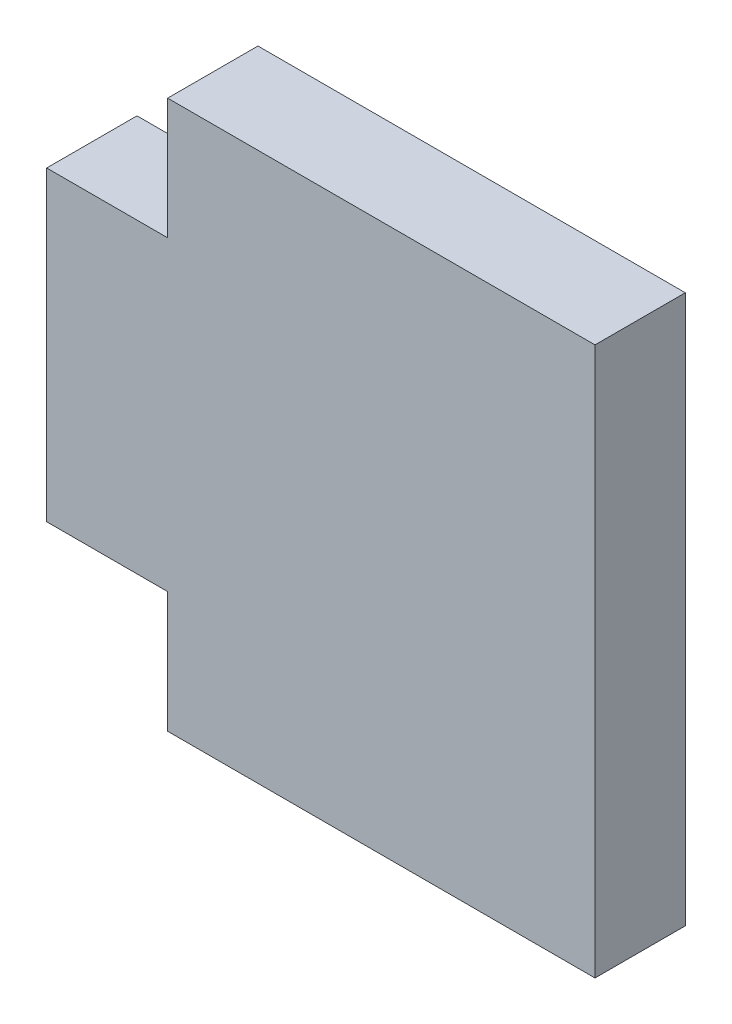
ISO-10303-21;
HEADER;
FILE_DESCRIPTION(('STEP AP214'),'2;1');
FILE_NAME('part.step','',(''),(''),'','','');
FILE_SCHEMA(('AUTOMOTIVE_DESIGN { 1 0 10303 214 1 1 1 1 }'));
ENDSEC;
DATA;
#1=APPLICATION_CONTEXT('core data for automotive mechanical design processes');
#2=APPLICATION_PROTOCOL_DEFINITION('international standard','automotive_design',2000,#1);
#3=PRODUCT_CONTEXT('',#1,'mechanical');
#4=PRODUCT('Part','Part','',(#3));
#5=PRODUCT_RELATED_PRODUCT_CATEGORY('part','',(#4));
#6=PRODUCT_DEFINITION_FORMATION('','',#4);
#7=PRODUCT_DEFINITION_CONTEXT('part definition',#1,'design');
#8=PRODUCT_DEFINITION('design','',#6,#7);
#9=PRODUCT_DEFINITION_SHAPE('','',#8);
#10=(LENGTH_UNIT() NAMED_UNIT(*) SI_UNIT(.MILLI.,.METRE.));
#11=(NAMED_UNIT(*) PLANE_ANGLE_UNIT() SI_UNIT($,.RADIAN.));
#12=(NAMED_UNIT(*) SI_UNIT($,.STERADIAN.) SOLID_ANGLE_UNIT());
#13=UNCERTAINTY_MEASURE_WITH_UNIT(LENGTH_MEASURE(1.E-05),#10,'distance_accuracy_value','');
#14=(GEOMETRIC_REPRESENTATION_CONTEXT(3) GLOBAL_UNCERTAINTY_ASSIGNED_CONTEXT((#13)) GLOBAL_UNIT_ASSIGNED_CONTEXT((#10,
#11,#12)) REPRESENTATION_CONTEXT('',''));
#15=CARTESIAN_POINT('',(0.,0.,0.));
#16=DIRECTION('',(0.,0.,1.));
#17=DIRECTION('',(1.,0.,0.));
#18=AXIS2_PLACEMENT_3D('',#15,#16,#17);
#19=CARTESIAN_POINT('',(0.,0.,7.112));
#20=DIRECTION('',(1.,0.,0.));
#21=DIRECTION('',(0.,1.,0.));
#22=AXIS2_PLACEMENT_3D('',#19,#20,#21);
#23=PLANE('',#22);
#24=DIRECTION('',(0.,-1.,0.));
#25=VECTOR('',#24,1.);
#26=CARTESIAN_POINT('',(0.,0.,7.112));
#27=LINE('',#26,#25);
#28=CARTESIAN_POINT('',(0.,33.655,7.112));
#29=VERTEX_POINT('',#28);
#30=CARTESIAN_POINT('',(0.,9.525,7.112));
#31=VERTEX_POINT('',#30);
#32=EDGE_CURVE('E125',#29,#31,#27,.T.);
#33=ORIENTED_EDGE('',*,*,#32,.F.);
#34=DIRECTION('',(0.,0.,1.));
#35=VECTOR('',#34,1.);
#36=CARTESIAN_POINT('',(0.,33.655,-11.684));
#37=LINE('',#36,#35);
#38=CARTESIAN_POINT('',(0.,33.655,0.));
#39=VERTEX_POINT('',#38);
#40=EDGE_CURVE('E107',#39,#29,#37,.T.);
#41=ORIENTED_EDGE('',*,*,#40,.F.);
#42=DIRECTION('',(0.,-1.,0.));
#43=VECTOR('',#42,1.);
#44=CARTESIAN_POINT('',(0.,0.,0.));
#45=LINE('',#44,#43);
#46=CARTESIAN_POINT('',(0.,9.525,0.));
#47=VERTEX_POINT('',#46);
#48=EDGE_CURVE('E151',#39,#47,#45,.T.);
#49=ORIENTED_EDGE('',*,*,#48,.T.);
#50=DIRECTION('',(0.,0.,1.));
#51=VECTOR('',#50,1.);
#52=CARTESIAN_POINT('',(0.,9.525,-11.684));
#53=LINE('',#52,#51);
#54=EDGE_CURVE('E130',#47,#31,#53,.T.);
#55=ORIENTED_EDGE('',*,*,#54,.T.);
#56=EDGE_LOOP('',(#33,#41,#49,#55));
#57=FACE_BOUND('',#56,.T.);
#58=ADVANCED_FACE('F45',(#57),#23,.F.);
#59=CARTESIAN_POINT('',(0.,0.,7.112));
#60=DIRECTION('',(0.,1.,0.));
#61=DIRECTION('',(0.,0.,1.));
#62=AXIS2_PLACEMENT_3D('',#59,#60,#61);
#63=PLANE('',#62);
#64=DIRECTION('',(1.,0.,0.));
#65=VECTOR('',#64,1.);
#66=CARTESIAN_POINT('',(0.,0.,7.112));
#67=LINE('',#66,#65);
#68=CARTESIAN_POINT('',(9.525,0.,7.112));
#69=VERTEX_POINT('',#68);
#70=CARTESIAN_POINT('',(43.18,0.,7.112));
#71=VERTEX_POINT('',#70);
#72=EDGE_CURVE('E132',#69,#71,#67,.T.);
#73=ORIENTED_EDGE('',*,*,#72,.F.);
#74=DIRECTION('',(0.,0.,1.));
#75=VECTOR('',#74,1.);
#76=CARTESIAN_POINT('',(9.525,0.,-11.684));
#77=LINE('',#76,#75);
#78=CARTESIAN_POINT('',(9.525,0.,0.));
#79=VERTEX_POINT('',#78);
#80=EDGE_CURVE('E184',#79,#69,#77,.T.);
#81=ORIENTED_EDGE('',*,*,#80,.F.);
#82=DIRECTION('',(1.,0.,0.));
#83=VECTOR('',#82,1.);
#84=CARTESIAN_POINT('',(0.,0.,0.));
#85=LINE('',#84,#83);
#86=CARTESIAN_POINT('',(43.18,0.,0.));
#87=VERTEX_POINT('',#86);
#88=EDGE_CURVE('E154',#79,#87,#85,.T.);
#89=ORIENTED_EDGE('',*,*,#88,.T.);
#90=DIRECTION('',(0.,0.,-1.));
#91=VECTOR('',#90,1.);
#92=CARTESIAN_POINT('',(43.18,0.,7.112));
#93=LINE('',#92,#91);
#94=EDGE_CURVE('E163',#71,#87,#93,.T.);
#95=ORIENTED_EDGE('',*,*,#94,.F.);
#96=EDGE_LOOP('',(#73,#81,#89,#95));
#97=FACE_BOUND('',#96,.T.);
#98=ADVANCED_FACE('F188',(#97),#63,.F.);
#99=CARTESIAN_POINT('',(43.18,0.,7.112));
#100=DIRECTION('',(-1.,0.,0.));
#101=DIRECTION('',(0.,-1.,0.));
#102=AXIS2_PLACEMENT_3D('',#99,#100,#101);
#103=PLANE('',#102);
#104=DIRECTION('',(0.,1.,0.));
#105=VECTOR('',#104,1.);
#106=CARTESIAN_POINT('',(43.18,0.,0.));
#107=LINE('',#106,#105);
#108=CARTESIAN_POINT('',(43.18,43.18,0.));
#109=VERTEX_POINT('',#108);
#110=EDGE_CURVE('E140',#87,#109,#107,.T.);
#111=ORIENTED_EDGE('',*,*,#110,.T.);
#112=DIRECTION('',(0.,0.,-1.));
#113=VECTOR('',#112,1.);
#114=CARTESIAN_POINT('',(43.18,43.18,7.112));
#115=LINE('',#114,#113);
#116=CARTESIAN_POINT('',(43.18,43.18,7.112));
#117=VERTEX_POINT('',#116);
#118=EDGE_CURVE('E150',#117,#109,#115,.T.);
#119=ORIENTED_EDGE('',*,*,#118,.F.);
#120=DIRECTION('',(0.,1.,0.));
#121=VECTOR('',#120,1.);
#122=CARTESIAN_POINT('',(43.18,0.,7.112));
#123=LINE('',#122,#121);
#124=EDGE_CURVE('E137',#71,#117,#123,.T.);
#125=ORIENTED_EDGE('',*,*,#124,.F.);
#126=ORIENTED_EDGE('',*,*,#94,.T.);
#127=EDGE_LOOP('',(#111,#119,#125,#126));
#128=FACE_BOUND('',#127,.T.);
#129=ADVANCED_FACE('F214',(#128),#103,.F.);
#130=CARTESIAN_POINT('',(0.,43.18,7.112));
#131=DIRECTION('',(0.,-1.,0.));
#132=DIRECTION('',(0.,0.,-1.));
#133=AXIS2_PLACEMENT_3D('',#130,#131,#132);
#134=PLANE('',#133);
#135=DIRECTION('',(-1.,0.,0.));
#136=VECTOR('',#135,1.);
#137=CARTESIAN_POINT('',(0.,43.18,0.));
#138=LINE('',#137,#136);
#139=CARTESIAN_POINT('',(9.525,43.18,0.));
#140=VERTEX_POINT('',#139);
#141=EDGE_CURVE('E133',#109,#140,#138,.T.);
#142=ORIENTED_EDGE('',*,*,#141,.T.);
#143=DIRECTION('',(0.,0.,1.));
#144=VECTOR('',#143,1.);
#145=CARTESIAN_POINT('',(9.525,43.18,-11.684));
#146=LINE('',#145,#144);
#147=CARTESIAN_POINT('',(9.525,43.18,7.112));
#148=VERTEX_POINT('',#147);
#149=EDGE_CURVE('E155',#140,#148,#146,.T.);
#150=ORIENTED_EDGE('',*,*,#149,.T.);
#151=DIRECTION('',(-1.,0.,0.));
#152=VECTOR('',#151,1.);
#153=CARTESIAN_POINT('',(0.,43.18,7.112));
#154=LINE('',#153,#152);
#155=EDGE_CURVE('E147',#117,#148,#154,.T.);
#156=ORIENTED_EDGE('',*,*,#155,.F.);
#157=ORIENTED_EDGE('',*,*,#118,.T.);
#158=EDGE_LOOP('',(#142,#150,#156,#157));
#159=FACE_BOUND('',#158,.T.);
#160=ADVANCED_FACE('F209',(#159),#134,.F.);
#161=CARTESIAN_POINT('',(0.,0.,7.112));
#162=DIRECTION('',(0.,0.,-1.));
#163=DIRECTION('',(-1.,0.,0.));
#164=AXIS2_PLACEMENT_3D('',#161,#162,#163);
#165=PLANE('',#164);
#166=ORIENTED_EDGE('',*,*,#155,.T.);
#167=DIRECTION('',(0.,1.,0.));
#168=VECTOR('',#167,1.);
#169=CARTESIAN_POINT('',(9.525,43.18,7.112));
#170=LINE('',#169,#168);
#171=CARTESIAN_POINT('',(9.525,33.655,7.112));
#172=VERTEX_POINT('',#171);
#173=EDGE_CURVE('E118',#172,#148,#170,.T.);
#174=ORIENTED_EDGE('',*,*,#173,.F.);
#175=DIRECTION('',(1.,0.,0.));
#176=VECTOR('',#175,1.);
#177=CARTESIAN_POINT('',(0.,33.655,7.112));
#178=LINE('',#177,#176);
#179=EDGE_CURVE('E110',#29,#172,#178,.T.);
#180=ORIENTED_EDGE('',*,*,#179,.F.);
#181=ORIENTED_EDGE('',*,*,#32,.T.);
#182=DIRECTION('',(-1.,0.,0.));
#183=VECTOR('',#182,1.);
#184=CARTESIAN_POINT('',(0.,9.525,7.112));
#185=LINE('',#184,#183);
#186=CARTESIAN_POINT('',(9.525,9.525,7.112));
#187=VERTEX_POINT('',#186);
#188=EDGE_CURVE('E191',#187,#31,#185,.T.);
#189=ORIENTED_EDGE('',*,*,#188,.F.);
#190=DIRECTION('',(0.,1.,0.));
#191=VECTOR('',#190,1.);
#192=CARTESIAN_POINT('',(9.525,0.,7.112));
#193=LINE('',#192,#191);
#194=EDGE_CURVE('E127',#69,#187,#193,.T.);
#195=ORIENTED_EDGE('',*,*,#194,.F.);
#196=ORIENTED_EDGE('',*,*,#72,.T.);
#197=ORIENTED_EDGE('',*,*,#124,.T.);
#198=EDGE_LOOP('',(#166,#174,#180,#181,#189,#195,#196,#197));
#199=FACE_BOUND('',#198,.T.);
#200=ADVANCED_FACE('F123',(#199),#165,.F.);
#201=CARTESIAN_POINT('',(0.,0.,0.));
#202=DIRECTION('',(0.,0.,-1.));
#203=DIRECTION('',(-1.,0.,0.));
#204=AXIS2_PLACEMENT_3D('',#201,#202,#203);
#205=PLANE('',#204);
#206=DIRECTION('',(0.,-1.,0.));
#207=VECTOR('',#206,1.);
#208=CARTESIAN_POINT('',(9.52499999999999,0.,0.));
#209=LINE('',#208,#207);
#210=CARTESIAN_POINT('',(9.525,33.655,0.));
#211=VERTEX_POINT('',#210);
#212=EDGE_CURVE('E11',#140,#211,#209,.T.);
#213=ORIENTED_EDGE('',*,*,#212,.F.);
#214=ORIENTED_EDGE('',*,*,#141,.F.);
#215=ORIENTED_EDGE('',*,*,#110,.F.);
#216=ORIENTED_EDGE('',*,*,#88,.F.);
#217=DIRECTION('',(0.,-1.,0.));
#218=VECTOR('',#217,1.);
#219=CARTESIAN_POINT('',(9.525,0.,0.));
#220=LINE('',#219,#218);
#221=CARTESIAN_POINT('',(9.525,9.525,0.));
#222=VERTEX_POINT('',#221);
#223=EDGE_CURVE('E167',#222,#79,#220,.T.);
#224=ORIENTED_EDGE('',*,*,#223,.F.);
#225=DIRECTION('',(1.,0.,0.));
#226=VECTOR('',#225,1.);
#227=CARTESIAN_POINT('',(0.,9.525,0.));
#228=LINE('',#227,#226);
#229=EDGE_CURVE('E170',#47,#222,#228,.T.);
#230=ORIENTED_EDGE('',*,*,#229,.F.);
#231=ORIENTED_EDGE('',*,*,#48,.F.);
#232=DIRECTION('',(-1.,0.,0.));
#233=VECTOR('',#232,1.);
#234=CARTESIAN_POINT('',(0.,33.655,0.));
#235=LINE('',#234,#233);
#236=EDGE_CURVE('E53',#211,#39,#235,.T.);
#237=ORIENTED_EDGE('',*,*,#236,.F.);
#238=EDGE_LOOP('',(#213,#214,#215,#216,#224,#230,#231,#237));
#239=FACE_BOUND('',#238,.T.);
#240=ADVANCED_FACE('F180',(#239),#205,.T.);
#241=CARTESIAN_POINT('',(0.,9.525,-11.684));
#242=DIRECTION('',(0.,1.,0.));
#243=DIRECTION('',(0.,0.,1.));
#244=AXIS2_PLACEMENT_3D('',#241,#242,#243);
#245=PLANE('',#244);
#246=ORIENTED_EDGE('',*,*,#229,.T.);
#247=DIRECTION('',(0.,0.,1.));
#248=VECTOR('',#247,1.);
#249=CARTESIAN_POINT('',(9.525,9.525,-11.684));
#250=LINE('',#249,#248);
#251=EDGE_CURVE('E67',#222,#187,#250,.T.);
#252=ORIENTED_EDGE('',*,*,#251,.T.);
#253=ORIENTED_EDGE('',*,*,#188,.T.);
#254=ORIENTED_EDGE('',*,*,#54,.F.);
#255=EDGE_LOOP('',(#246,#252,#253,#254));
#256=FACE_BOUND('',#255,.T.);
#257=ADVANCED_FACE('F176',(#256),#245,.F.);
#258=CARTESIAN_POINT('',(9.525,0.,-11.684));
#259=DIRECTION('',(1.,0.,0.));
#260=DIRECTION('',(0.,1.,0.));
#261=AXIS2_PLACEMENT_3D('',#258,#259,#260);
#262=PLANE('',#261);
#263=ORIENTED_EDGE('',*,*,#223,.T.);
#264=ORIENTED_EDGE('',*,*,#80,.T.);
#265=ORIENTED_EDGE('',*,*,#194,.T.);
#266=ORIENTED_EDGE('',*,*,#251,.F.);
#267=EDGE_LOOP('',(#263,#264,#265,#266));
#268=FACE_BOUND('',#267,.T.);
#269=ADVANCED_FACE('F183',(#268),#262,.F.);
#270=CARTESIAN_POINT('',(9.525,43.18,-11.684));
#271=DIRECTION('',(1.,0.,0.));
#272=DIRECTION('',(0.,1.,0.));
#273=AXIS2_PLACEMENT_3D('',#270,#271,#272);
#274=PLANE('',#273);
#275=ORIENTED_EDGE('',*,*,#212,.T.);
#276=DIRECTION('',(0.,0.,1.));
#277=VECTOR('',#276,1.);
#278=CARTESIAN_POINT('',(9.525,33.655,-11.684));
#279=LINE('',#278,#277);
#280=EDGE_CURVE('E60',#211,#172,#279,.T.);
#281=ORIENTED_EDGE('',*,*,#280,.T.);
#282=ORIENTED_EDGE('',*,*,#173,.T.);
#283=ORIENTED_EDGE('',*,*,#149,.F.);
#284=EDGE_LOOP('',(#275,#281,#282,#283));
#285=FACE_BOUND('',#284,.T.);
#286=ADVANCED_FACE('F206',(#285),#274,.F.);
#287=CARTESIAN_POINT('',(0.,33.655,-11.684));
#288=DIRECTION('',(0.,-1.,0.));
#289=DIRECTION('',(0.,0.,-1.));
#290=AXIS2_PLACEMENT_3D('',#287,#288,#289);
#291=PLANE('',#290);
#292=ORIENTED_EDGE('',*,*,#236,.T.);
#293=ORIENTED_EDGE('',*,*,#40,.T.);
#294=ORIENTED_EDGE('',*,*,#179,.T.);
#295=ORIENTED_EDGE('',*,*,#280,.F.);
#296=EDGE_LOOP('',(#292,#293,#294,#295));
#297=FACE_BOUND('',#296,.T.);
#298=ADVANCED_FACE('F109',(#297),#291,.F.);
#299=CLOSED_SHELL('',(#58,#98,#129,#160,#200,#240,#257,#269,#286,#298));
#300=MANIFOLD_SOLID_BREP('B2',#299);
#301=ADVANCED_BREP_SHAPE_REPRESENTATION('',(#18,#300),#14);
#302=SHAPE_DEFINITION_REPRESENTATION(#9,#301);
ENDSEC;
END-ISO-10303-21;
